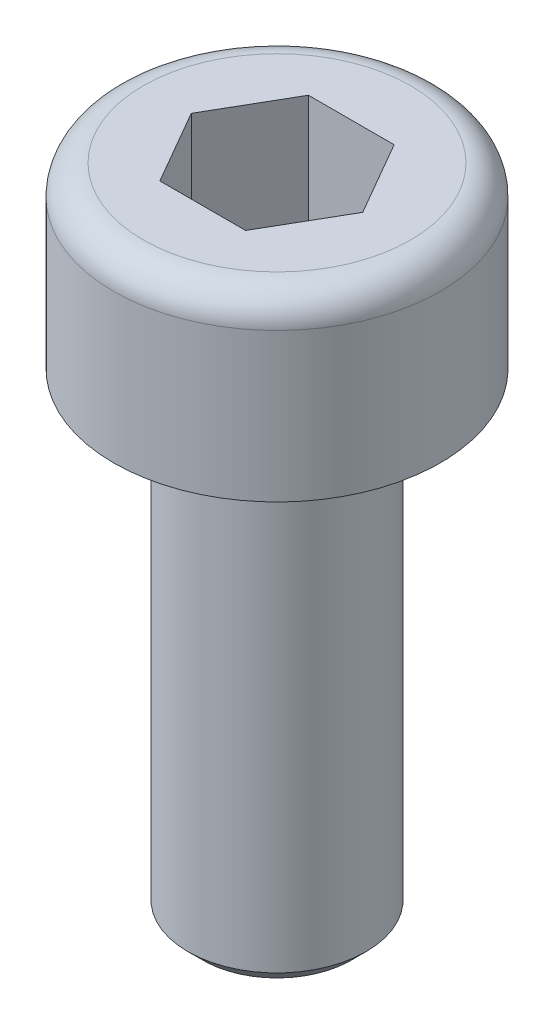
from build123d import *

# Parameters (mm, degrees)
ENL_V_MAT_EXTRU_1_DEPTH = 2
CHANFREIN1_SIZE         = 0.25


with BuildPart() as part:
    # Esquisse1 → Base-R_volution (revolve)
    with BuildSketch(Plane.XY, mode=Mode.PRIVATE) as base_r_volution_sk:
        with BuildLine():
            Line((0, 11), (-2.25, 11))
            ThreePointArc((-2.25, 11), (-2.603553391, 10.853553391), (-2.75, 10.5))
            Line((-2.75, 10.5), (-2.75, 8))
            Line((-2.75, 8), (-1.5, 8))
            Line((-1.5, 8), (-1.5, 0))
            Line((-1.5, 0), (0, 0))
            Line((0, 0), (0, 11))
        make_face()
    revolve(base_r_volution_sk.sketch.rotate(Axis((0, 20.989829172, 0), (0, -1, 0)), 270), axis=Axis((0, 20.989829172, 0), (0, -1, 0)))

    # Esquisse2 → Enl_v. mat.-Extru.1 (cut)
    with BuildSketch(Plane(origin=(0, 11, 0), x_dir=(-1, 0, 0), z_dir=(0, 1, 0))):
        Polygon((1.443375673, 0), (0.721687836, -1.25), (-0.721687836, -1.25), (-1.443375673, 0), (-0.721687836, 1.25), (0.721687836, 1.25), align=None)
    extrude(amount=-ENL_V_MAT_EXTRU_1_DEPTH, mode=Mode.SUBTRACT)

    # Chanfrein1
    chanfrein1_edges = [part.edges().sort_by_distance(p)[0] for p in [
        (0, 0, -1.5),
    ]]
    chamfer(chanfrein1_edges, length=CHANFREIN1_SIZE)


solid = part.part
